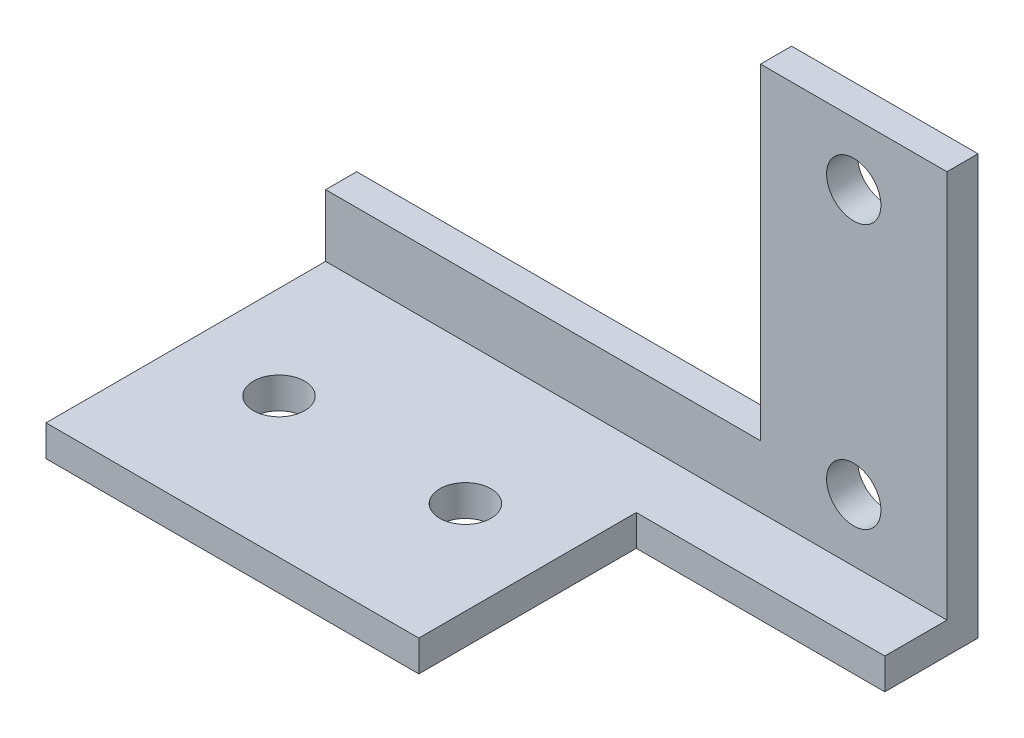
from build123d import *

# Parameters (mm, degrees)
EXTRUDE1_DEPTH    = 40
SKETCH3_W         = 28
SKETCH3_H         = 21
EXTRUDE3_DEPTH    = 40
SKETCH4_W         = 16
SKETCH4_H         = 14
EXTRUDE4_DEPTH    = 40
SKETCH5_R         = 1.75
EXTRUDE5_DEPTH    = 40
M4_TAPPED_HOLE1_D = 3.3


with BuildPart() as part:
    # Sketch1 → Extrude1 (new body)
    with BuildSketch(Plane(origin=(0, 0, 0), x_dir=(0, 0, -1), z_dir=(1, 0, 0))):
        Polygon((0, 27), (0, 0), (-20, 0), (-20, 2), (-2, 2), (-2, 27), align=None)
    extrude(amount=EXTRUDE1_DEPTH)

    # Sketch3 → Extrude3 (cut)
    with BuildSketch(Plane(origin=(0, 0, 0), x_dir=(-1, 0, 0), z_dir=(0, 0, -1))):
        with Locations((-14, 16.5)):
            Rectangle(SKETCH3_W, SKETCH3_H)
    extrude(amount=-EXTRUDE3_DEPTH, mode=Mode.SUBTRACT)

    # Sketch4 → Extrude4 (cut)
    with BuildSketch(Plane(origin=(0, 2, 0), x_dir=(1, 0, 0), z_dir=(0, 1, 0))):
        with Locations((32, -13)):
            Rectangle(SKETCH4_W, SKETCH4_H)
    extrude(amount=-EXTRUDE4_DEPTH, mode=Mode.SUBTRACT)

    # Sketch5 → Extrude5 (cut)
    with BuildSketch(Plane(origin=(0, 0, 0), x_dir=(-1, 0, 0), z_dir=(0, 0, -1))):
        with Locations(Location((-34, 23, 0), (0, 0, 90))):
            Circle(SKETCH5_R)
        with Locations(Location((-34, 6, 0), (0, 0, 90))):
            Circle(SKETCH5_R)
    extrude(amount=-EXTRUDE5_DEPTH, mode=Mode.SUBTRACT)

    # M4 Tapped Hole1 (through all)
    with Locations(Plane(origin=(6, 2, 11), x_dir=(0, 0, 1), z_dir=(0, 1, 0))):
        with Locations((0, 0), (0, 12)):
            Hole(M4_TAPPED_HOLE1_D / 2)


solid = part.part
